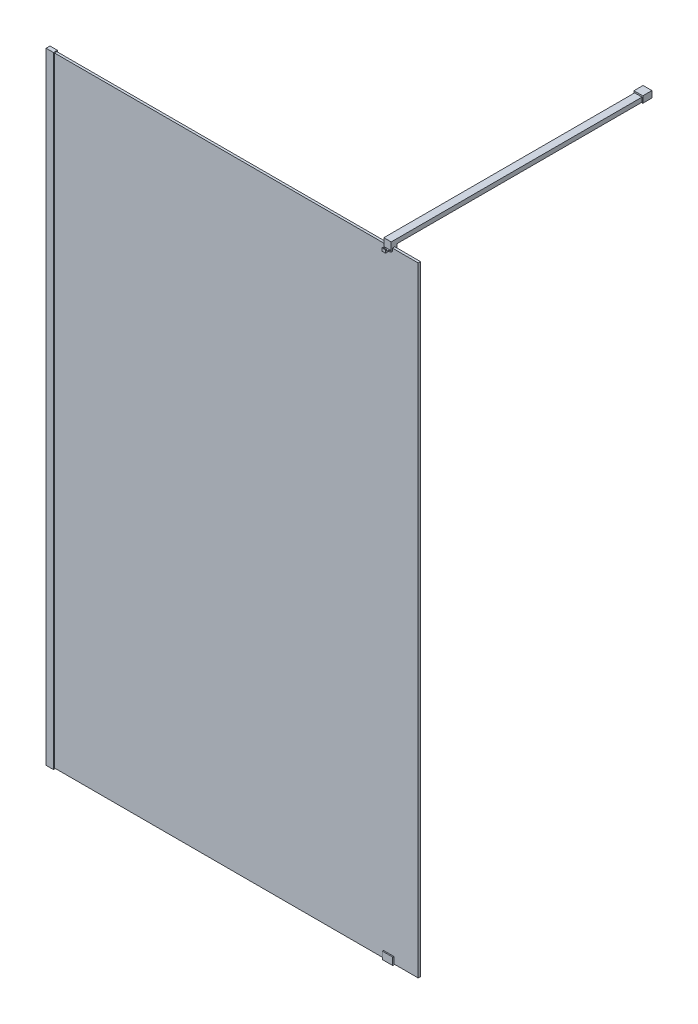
from build123d import *

# Parameters (mm, degrees)
DODANIE_WYCI_GNI_CIE1_DEPTH     = 2100
SZKIC2_W                        = 1247
SZKIC2_H                        = 8
DODANIE_WYCI_GNI_CIE2_DEPTH     = 2100
SZKIC4_W                        = 25
SZKIC4_H                        = 13.3
DODANIE_WYCI_GNI_CIE3_DEPTH     = 3
SZKIC5_W                        = 25
SZKIC5_H                        = 13.3
DODANIE_WYCI_GNI_CIE4_DEPTH     = 3
DODANIE_WYCI_GNI_CIE5_DEPTH     = 17.5
DODANIE_WYCI_GNI_CIE6_DEPTH     = 12.5
WYTNIJ_WYCI_GNI_CIE1_DEPTH      = 2451.853272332
WYTNIJ_WYCI_GNI_CIE1_DEPTH_BACK = 2451.853272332
SZKIC10_W                       = 25
SZKIC10_H                       = 861.63
DODANIE_WYCI_GNI_CIE7_DEPTH     = 15
SZKIC14_W                       = 30
SZKIC14_H                       = 22
DODANIE_WYCI_GNI_CIE8_DEPTH     = 31


with BuildPart() as part:
    # Szkic1 → Dodanie-wyci_gni_cie1 (new body)
    with BuildSketch(Plane(origin=(0, 0, 0), x_dir=(1, 0, 0), z_dir=(0, 1, 0))):
        Polygon((0, 0), (0, 13.3), (25, 13.3), (25, 11.4), (11.45, 11.4), (11.45, 3.4), (25, 3.4), (25, 0), align=None)
    extrude(amount=DODANIE_WYCI_GNI_CIE1_DEPTH)

    # Szkic4 → Dodanie-wyci_gni_cie3 (add)
    with BuildSketch(Plane(origin=(0, 2100, 0), x_dir=(1, 0, 0), z_dir=(0, 1, 0))):
        with Locations((12.5, 6.65)):
            Rectangle(SZKIC4_W, SZKIC4_H)
    extrude(amount=DODANIE_WYCI_GNI_CIE3_DEPTH)

    # Szkic5 → Dodanie-wyci_gni_cie4 (add)
    with BuildSketch(Plane.XZ):
        with Locations((12.5, -6.65)):
            Rectangle(SZKIC5_W, SZKIC5_H)
    extrude(amount=DODANIE_WYCI_GNI_CIE4_DEPTH)


with BuildPart() as body_2:
    # Szkic2 → Dodanie-wyci_gni_cie2 (new body)
    with BuildSketch(Plane.XZ):
        with Locations((634.95, -7.4)):
            Rectangle(SZKIC2_W, SZKIC2_H)
    extrude(amount=-DODANIE_WYCI_GNI_CIE2_DEPTH)


with BuildPart() as body_3:
    # Szkic6 → Dodanie-wyci_gni_cie5 (new, symmetric)
    with BuildSketch(Plane(origin=(1158.45, 0, 0), x_dir=(0, 0, -1), z_dir=(1, 0, 0))):
        Polygon((11.4, 22), (15.75, 22), (15.75, -3), (-0.35, -3), (-0.35, 22), (3.4, 22), (3.4, 0), (11.4, 0), align=None)
    extrude(amount=DODANIE_WYCI_GNI_CIE5_DEPTH, both=True)


with BuildPart() as body_4:
    # Szkic7 → Dodanie-wyci_gni_cie6 (new, symmetric)
    with BuildSketch(Plane(origin=(1158.45, 0, 0), x_dir=(0, 0, -1), z_dir=(1, 0, 0))):
        Polygon((-0.6, 2120), (19.4, 2120), (19.4, 2090), (11.4, 2090), (11.4, 2100), (3.4, 2100), (3.4, 2090), (-13.37, 2090), (-13.37, 2100), (-10.37, 2100), (-9.845068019, 2094), (-0.6, 2094), align=None)
    extrude(amount=DODANIE_WYCI_GNI_CIE6_DEPTH, both=True)

    # Szkic8 → Wytnij-wyci_gni_cie1 (cut, two sides: drawn at the far end of the back side and taken through both)
    with BuildSketch(Plane(origin=(0, 2100, 0), x_dir=(1, 0, 0), z_dir=(0, 1, 0)).offset(-WYTNIJ_WYCI_GNI_CIE1_DEPTH_BACK)):
        Polygon((-985.904859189, 993.500246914), (1145.95, -0.6), (1152.45, -3.630999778), (1152.45, -13.37), (1164.45, -13.37), (1164.45, -3.630999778), (1170.95, -0.6), (3302.804859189, 993.500246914), (3302.804859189, -3710.982909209), (-985.904859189, -3710.982909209), align=None)
    extrude(amount=WYTNIJ_WYCI_GNI_CIE1_DEPTH + WYTNIJ_WYCI_GNI_CIE1_DEPTH_BACK, mode=Mode.SUBTRACT)

    # Szkic10 → Dodanie-wyci_gni_cie7 (add)
    with BuildSketch(Plane(origin=(0, 2120, 0), x_dir=(1, 0, 0), z_dir=(0, 1, 0))):
        with Locations((1158.45, 450.215)):
            Rectangle(SZKIC10_W, SZKIC10_H)
    extrude(amount=-DODANIE_WYCI_GNI_CIE7_DEPTH)

    # Szkic14 → Dodanie-wyci_gni_cie8 (add)
    with BuildSketch(Plane(origin=(0, 0, -881.03), x_dir=(-1, 0, 0), z_dir=(0, 0, -1))):
        with Locations((-1158.45, 2114)):
            Rectangle(SZKIC14_W, SZKIC14_H)
    extrude(amount=-DODANIE_WYCI_GNI_CIE8_DEPTH)


solid = Compound([part.part, body_2.part, body_3.part, body_4.part])
